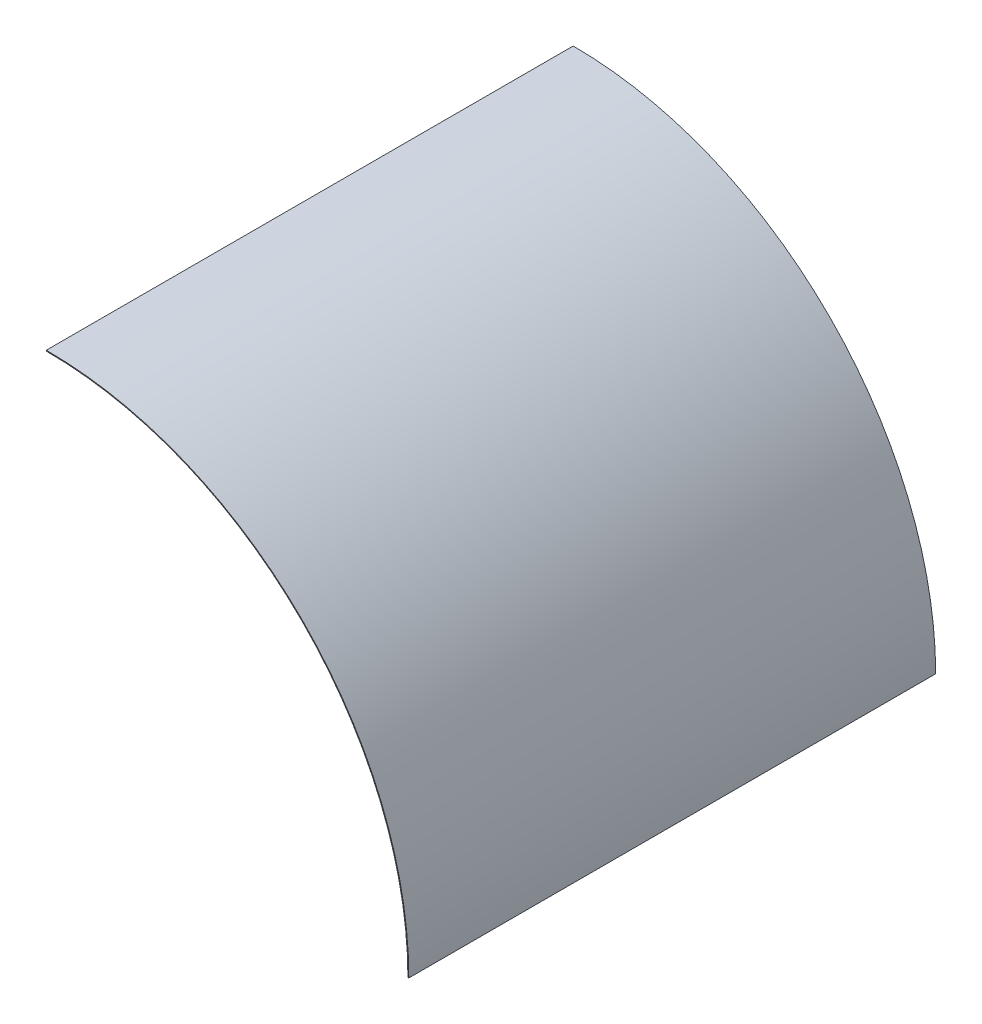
from build123d import *

# Parameters (mm, degrees)
BOSS_EXTRUDE1_DEPTH = 3000


with BuildPart() as part:
    # Sketch1 → Boss-Extrude1 (new body)
    with BuildSketch(Plane.XY):
        with BuildLine():
            Line((0, 2064), (0, 2059))
            ThreePointArc((0, 2059), (1455.932862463, 1455.932862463), (2059, 0))
            Line((2059, 0), (2064, 0))
            ThreePointArc((2064, 0), (1459.468396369, 1459.468396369), (0, 2064))
        make_face()
    extrude(amount=-BOSS_EXTRUDE1_DEPTH)


solid = part.part
